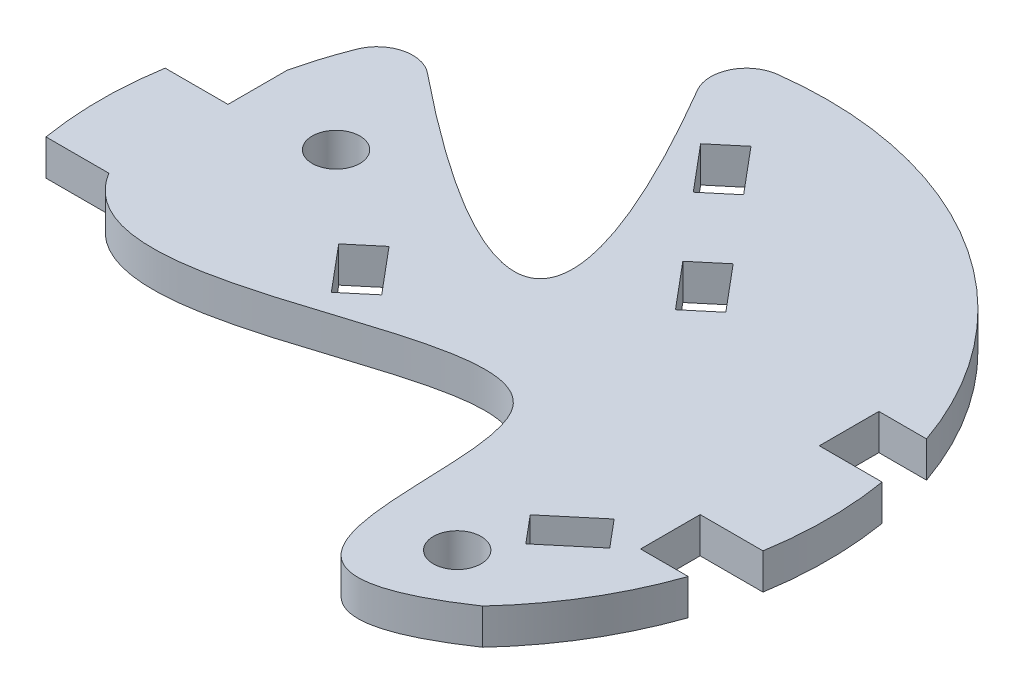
ISO-10303-21;
HEADER;
FILE_DESCRIPTION(('STEP AP214'),'2;1');
FILE_NAME('part.step','',(''),(''),'','','');
FILE_SCHEMA(('AUTOMOTIVE_DESIGN { 1 0 10303 214 1 1 1 1 }'));
ENDSEC;
DATA;
#1=APPLICATION_CONTEXT('core data for automotive mechanical design processes');
#2=APPLICATION_PROTOCOL_DEFINITION('international standard','automotive_design',2000,#1);
#3=PRODUCT_CONTEXT('',#1,'mechanical');
#4=PRODUCT('Part','Part','',(#3));
#5=PRODUCT_RELATED_PRODUCT_CATEGORY('part','',(#4));
#6=PRODUCT_DEFINITION_FORMATION('','',#4);
#7=PRODUCT_DEFINITION_CONTEXT('part definition',#1,'design');
#8=PRODUCT_DEFINITION('design','',#6,#7);
#9=PRODUCT_DEFINITION_SHAPE('','',#8);
#10=(LENGTH_UNIT() NAMED_UNIT(*) SI_UNIT(.MILLI.,.METRE.));
#11=(NAMED_UNIT(*) PLANE_ANGLE_UNIT() SI_UNIT($,.RADIAN.));
#12=(NAMED_UNIT(*) SI_UNIT($,.STERADIAN.) SOLID_ANGLE_UNIT());
#13=UNCERTAINTY_MEASURE_WITH_UNIT(LENGTH_MEASURE(1.E-05),#10,'distance_accuracy_value','');
#14=(GEOMETRIC_REPRESENTATION_CONTEXT(3) GLOBAL_UNCERTAINTY_ASSIGNED_CONTEXT((#13)) GLOBAL_UNIT_ASSIGNED_CONTEXT((#10,
#11,#12)) REPRESENTATION_CONTEXT('',''));
#15=CARTESIAN_POINT('',(0.,0.,0.));
#16=DIRECTION('',(0.,0.,1.));
#17=DIRECTION('',(1.,0.,0.));
#18=AXIS2_PLACEMENT_3D('',#15,#16,#17);
#19=CARTESIAN_POINT('',(0.,3.,0.));
#20=DIRECTION('',(0.,1.,0.));
#21=DIRECTION('',(0.,0.,1.));
#22=AXIS2_PLACEMENT_3D('',#19,#20,#21);
#23=PLANE('',#22);
#24=DIRECTION('',(0.642787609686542,0.,0.766044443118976));
#25=VECTOR('',#24,1.);
#26=CARTESIAN_POINT('',(4.40475554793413,3.,-3.69602875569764));
#27=LINE('',#26,#25);
#28=CARTESIAN_POINT('',(17.6970534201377,3.,12.1451149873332));
#29=VERTEX_POINT('',#28);
#30=CARTESIAN_POINT('',(19.6254162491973,3.,14.4432483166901));
#31=VERTEX_POINT('',#30);
#32=EDGE_CURVE('E508',#29,#31,#27,.T.);
#33=ORIENTED_EDGE('',*,*,#32,.F.);
#34=DIRECTION('',(0.766044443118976,0.,-0.642787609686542));
#35=VECTOR('',#34,1.);
#36=CARTESIAN_POINT('',(13.2922978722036,3.,15.8411437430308));
#37=LINE('',#36,#35);
#38=CARTESIAN_POINT('',(21.5272756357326,3.,8.9311769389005));
#39=VERTEX_POINT('',#38);
#40=EDGE_CURVE('E503',#29,#39,#37,.T.);
#41=ORIENTED_EDGE('',*,*,#40,.T.);
#42=DIRECTION('',(0.642787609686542,0.,0.766044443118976));
#43=VECTOR('',#42,1.);
#44=CARTESIAN_POINT('',(8.23497776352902,3.,-6.90996680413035));
#45=LINE('',#44,#43);
#46=CARTESIAN_POINT('',(23.4556384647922,3.,11.2293102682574));
#47=VERTEX_POINT('',#46);
#48=EDGE_CURVE('E514',#39,#47,#45,.T.);
#49=ORIENTED_EDGE('',*,*,#48,.T.);
#50=DIRECTION('',(0.766044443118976,0.,-0.642787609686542));
#51=VECTOR('',#50,1.);
#52=CARTESIAN_POINT('',(15.2206607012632,3.,18.1392770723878));
#53=LINE('',#52,#51);
#54=EDGE_CURVE('E511',#31,#47,#53,.T.);
#55=ORIENTED_EDGE('',*,*,#54,.F.);
#56=EDGE_LOOP('',(#33,#41,#49,#55));
#57=FACE_BOUND('',#56,.T.);
#58=CARTESIAN_POINT('',(-16.9835014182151,3.,-6.23863438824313));
#59=DIRECTION('',(0.,1.,0.));
#60=DIRECTION('',(0.,0.,1.));
#61=AXIS2_PLACEMENT_3D('',#58,#59,#60);
#62=CIRCLE('',#61,2.);
#63=CARTESIAN_POINT('',(-16.9835014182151,3.,-4.23863438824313));
#64=VERTEX_POINT('',#63);
#65=EDGE_CURVE('E530',#64,#64,#62,.F.);
#66=ORIENTED_EDGE('',*,*,#65,.T.);
#67=EDGE_LOOP('',(#66));
#68=FACE_BOUND('',#67,.T.);
#69=DIRECTION('',(-0.766044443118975,0.,0.642787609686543));
#70=VECTOR('',#69,1.);
#71=CARTESIAN_POINT('',(-3.90227068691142,3.,-4.65054511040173));
#72=LINE('',#71,#70);
#73=CARTESIAN_POINT('',(7.97141818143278,3.,-14.6137530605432));
#74=VERTEX_POINT('',#73);
#75=CARTESIAN_POINT('',(5.67328485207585,3.,-12.6853902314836));
#76=VERTEX_POINT('',#75);
#77=EDGE_CURVE('E620',#74,#76,#72,.T.);
#78=ORIENTED_EDGE('',*,*,#77,.F.);
#79=DIRECTION('',(0.642787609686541,0.,0.766044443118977));
#80=VECTOR('',#79,1.);
#81=CARTESIAN_POINT('',(11.8736888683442,3.,-9.96320795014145));
#82=LINE('',#81,#80);
#83=CARTESIAN_POINT('',(11.1853562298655,3.,-10.7835308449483));
#84=VERTEX_POINT('',#83);
#85=EDGE_CURVE('E610',#74,#84,#82,.T.);
#86=ORIENTED_EDGE('',*,*,#85,.T.);
#87=DIRECTION('',(-0.766044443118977,0.,0.642787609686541));
#88=VECTOR('',#87,1.);
#89=CARTESIAN_POINT('',(-0.688332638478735,3.,-0.820322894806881));
#90=LINE('',#89,#88);
#91=CARTESIAN_POINT('',(8.88722290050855,3.,-8.8551680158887));
#92=VERTEX_POINT('',#91);
#93=EDGE_CURVE('E626',#84,#92,#90,.T.);
#94=ORIENTED_EDGE('',*,*,#93,.T.);
#95=DIRECTION('',(0.64278760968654,0.,0.766044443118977));
#96=VECTOR('',#95,1.);
#97=CARTESIAN_POINT('',(9.57555553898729,3.,-8.03484512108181));
#98=LINE('',#97,#96);
#99=EDGE_CURVE('E623',#76,#92,#98,.T.);
#100=ORIENTED_EDGE('',*,*,#99,.F.);
#101=EDGE_LOOP('',(#78,#86,#94,#100));
#102=FACE_BOUND('',#101,.T.);
#103=CARTESIAN_POINT('',(0.,3.,0.));
#104=DIRECTION('',(0.,1.,0.));
#105=DIRECTION('',(0.,0.,1.));
#106=AXIS2_PLACEMENT_3D('',#103,#104,#105);
#107=CIRCLE('',#106,30.5);
#108=CARTESIAN_POINT('',(28.8140590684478,3.,-10.));
#109=VERTEX_POINT('',#108);
#110=CARTESIAN_POINT('',(-3.95861769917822,3.,-30.2420129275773));
#111=VERTEX_POINT('',#110);
#112=EDGE_CURVE('E788',#109,#111,#107,.T.);
#113=ORIENTED_EDGE('',*,*,#112,.T.);
#114=CARTESIAN_POINT('',(-3.56924546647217,3.,-27.2673887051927));
#115=DIRECTION('',(0.,1.,0.));
#116=DIRECTION('',(0.,0.,1.));
#117=AXIS2_PLACEMENT_3D('',#114,#115,#116);
#118=CIRCLE('',#117,3.);
#119=CARTESIAN_POINT('',(-6.16007700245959,3.,-25.7549099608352));
#120=VERTEX_POINT('',#119);
#121=EDGE_CURVE('E274',#111,#120,#118,.T.);
#122=ORIENTED_EDGE('',*,*,#121,.T.);
#123=CARTESIAN_POINT('',(-18.7453208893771,3.,-15.6645535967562));
#124=CARTESIAN_POINT('',(3.86700093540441,3.,2.57649625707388));
#125=CARTESIAN_POINT('',(8.09424648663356,3.,-2.49637913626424));
#126=CARTESIAN_POINT('',(-8.30734565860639,3.,-29.3468568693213));
#127=B_SPLINE_CURVE_WITH_KNOTS('',3,(#123,#124,#125,#126),.UNSPECIFIED.,.F.,.F.,(4,4),
(0.0405275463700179,1.),.UNSPECIFIED.);
#128=CARTESIAN_POINT('',(-18.7453208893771,3.,-15.6645535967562));
#129=VERTEX_POINT('',#128);
#130=EDGE_CURVE('E1199',#129,#120,#127,.T.);
#131=ORIENTED_EDGE('',*,*,#130,.F.);
#132=CARTESIAN_POINT('',(-20.6289102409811,3.,-13.3295822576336));
#133=DIRECTION('',(0.,1.,0.));
#134=DIRECTION('',(0.,0.,1.));
#135=AXIS2_PLACEMENT_3D('',#132,#133,#134);
#136=CIRCLE('',#135,3.);
#137=CARTESIAN_POINT('',(-23.4189051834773,3.,-14.4322736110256));
#138=VERTEX_POINT('',#137);
#139=EDGE_CURVE('E549',#138,#129,#136,.F.);
#140=ORIENTED_EDGE('',*,*,#139,.F.);
#141=CARTESIAN_POINT('',(-24.8140590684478,3.,5.));
#142=CARTESIAN_POINT('',(-26.3603422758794,3.,-1.58958445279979));
#143=CARTESIAN_POINT('',(-25.8362968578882,3.,-8.31586531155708));
#144=CARTESIAN_POINT('',(-23.4189051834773,3.,-14.4322736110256));
#145=B_SPLINE_CURVE_WITH_KNOTS('',3,(#141,#142,#143,#144),.UNSPECIFIED.,.F.,.F.,(4,4),(0.,
0.831813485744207),.UNSPECIFIED.);
#146=CARTESIAN_POINT('',(-24.8140590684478,3.,-10.));
#147=VERTEX_POINT('',#146);
#148=EDGE_CURVE('E1193',#147,#138,#145,.T.);
#149=ORIENTED_EDGE('',*,*,#148,.F.);
#150=DIRECTION('',(0.,0.,-1.));
#151=VECTOR('',#150,1.);
#152=CARTESIAN_POINT('',(-24.8140590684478,3.,0.));
#153=LINE('',#152,#151);
#154=CARTESIAN_POINT('',(-24.8140590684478,3.,-5.));
#155=VERTEX_POINT('',#154);
#156=EDGE_CURVE('E677',#155,#147,#153,.T.);
#157=ORIENTED_EDGE('',*,*,#156,.F.);
#158=DIRECTION('',(-1.,0.,0.));
#159=VECTOR('',#158,1.);
#160=CARTESIAN_POINT('',(0.,3.,-5.));
#161=LINE('',#160,#159);
#162=CARTESIAN_POINT('',(-30.0873727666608,3.,-5.));
#163=VERTEX_POINT('',#162);
#164=EDGE_CURVE('E674',#155,#163,#161,.T.);
#165=ORIENTED_EDGE('',*,*,#164,.T.);
#166=CARTESIAN_POINT('',(-30.0873727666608,3.,5.));
#167=VERTEX_POINT('',#166);
#168=EDGE_CURVE('E696',#163,#167,#107,.T.);
#169=ORIENTED_EDGE('',*,*,#168,.T.);
#170=DIRECTION('',(-1.,0.,0.));
#171=VECTOR('',#170,1.);
#172=CARTESIAN_POINT('',(0.,3.,5.00000000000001));
#173=LINE('',#172,#171);
#174=CARTESIAN_POINT('',(-24.8140590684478,3.,5.));
#175=VERTEX_POINT('',#174);
#176=EDGE_CURVE('E683',#175,#167,#173,.T.);
#177=ORIENTED_EDGE('',*,*,#176,.F.);
#178=CARTESIAN_POINT('',(22.3289408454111,3.,20.7766311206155));
#179=CARTESIAN_POINT('',(5.97375164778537,3.,31.8512079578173));
#180=CARTESIAN_POINT('',(22.176782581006,3.,-15.835204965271));
#181=CARTESIAN_POINT('',(-18.2068680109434,3.,15.8076452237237));
#182=CARTESIAN_POINT('',(-24.8140590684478,3.,5.));
#183=B_SPLINE_CURVE_WITH_KNOTS('',3,(#178,#179,#180,#181,#182),.UNSPECIFIED.,.F.,.F.,(4,1,4),
(0.,0.445790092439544,1.),.UNSPECIFIED.);
#184=CARTESIAN_POINT('',(22.3289408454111,3.,20.7766311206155));
#185=VERTEX_POINT('',#184);
#186=EDGE_CURVE('E595',#185,#175,#183,.T.);
#187=ORIENTED_EDGE('',*,*,#186,.F.);
#188=CARTESIAN_POINT('',(28.8140590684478,3.,10.));
#189=VERTEX_POINT('',#188);
#190=EDGE_CURVE('E692',#185,#189,#107,.T.);
#191=ORIENTED_EDGE('',*,*,#190,.T.);
#192=DIRECTION('',(1.,0.,0.));
#193=VECTOR('',#192,1.);
#194=CARTESIAN_POINT('',(0.,3.,10.));
#195=LINE('',#194,#193);
#196=CARTESIAN_POINT('',(24.8140590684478,3.,10.));
#197=VERTEX_POINT('',#196);
#198=EDGE_CURVE('E641',#197,#189,#195,.T.);
#199=ORIENTED_EDGE('',*,*,#198,.F.);
#200=DIRECTION('',(0.,0.,1.));
#201=VECTOR('',#200,1.);
#202=CARTESIAN_POINT('',(24.8140590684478,3.,0.));
#203=LINE('',#202,#201);
#204=CARTESIAN_POINT('',(24.8140590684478,3.,5.));
#205=VERTEX_POINT('',#204);
#206=EDGE_CURVE('E632',#205,#197,#203,.T.);
#207=ORIENTED_EDGE('',*,*,#206,.F.);
#208=DIRECTION('',(1.,0.,0.));
#209=VECTOR('',#208,1.);
#210=CARTESIAN_POINT('',(0.,3.,5.));
#211=LINE('',#210,#209);
#212=CARTESIAN_POINT('',(30.0873727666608,3.,5.));
#213=VERTEX_POINT('',#212);
#214=EDGE_CURVE('E644',#205,#213,#211,.T.);
#215=ORIENTED_EDGE('',*,*,#214,.T.);
#216=CARTESIAN_POINT('',(30.0873727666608,3.,-5.));
#217=VERTEX_POINT('',#216);
#218=EDGE_CURVE('E695',#213,#217,#107,.T.);
#219=ORIENTED_EDGE('',*,*,#218,.T.);
#220=DIRECTION('',(1.,0.,0.));
#221=VECTOR('',#220,1.);
#222=CARTESIAN_POINT('',(0.,3.,-5.00000000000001));
#223=LINE('',#222,#221);
#224=CARTESIAN_POINT('',(24.8140590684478,3.,-5.));
#225=VERTEX_POINT('',#224);
#226=EDGE_CURVE('E662',#225,#217,#223,.T.);
#227=ORIENTED_EDGE('',*,*,#226,.F.);
#228=DIRECTION('',(0.,0.,-1.));
#229=VECTOR('',#228,1.);
#230=CARTESIAN_POINT('',(24.8140590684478,3.,0.));
#231=LINE('',#230,#229);
#232=CARTESIAN_POINT('',(24.8140590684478,3.,-10.));
#233=VERTEX_POINT('',#232);
#234=EDGE_CURVE('E659',#225,#233,#231,.T.);
#235=ORIENTED_EDGE('',*,*,#234,.T.);
#236=DIRECTION('',(1.,0.,0.));
#237=VECTOR('',#236,1.);
#238=CARTESIAN_POINT('',(0.,3.,-10.));
#239=LINE('',#238,#237);
#240=EDGE_CURVE('E656',#233,#109,#239,.T.);
#241=ORIENTED_EDGE('',*,*,#240,.T.);
#242=EDGE_LOOP('',(#113,#122,#131,#140,#149,#157,#165,#169,#177,#187,#191,#199,#207,#215,#219,
#227,#235,#241));
#243=FACE_BOUND('',#242,.T.);
#244=DIRECTION('',(-0.766044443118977,0.,0.642787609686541));
#245=VECTOR('',#244,1.);
#246=CARTESIAN_POINT('',(-3.90227068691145,3.,-4.65054511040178));
#247=LINE('',#246,#245);
#248=CARTESIAN_POINT('',(-7.73249290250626,3.,-1.43660706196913));
#249=VERTEX_POINT('',#248);
#250=CARTESIAN_POINT('',(-10.0306262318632,3.,0.491755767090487));
#251=VERTEX_POINT('',#250);
#252=EDGE_CURVE('E537',#249,#251,#247,.T.);
#253=ORIENTED_EDGE('',*,*,#252,.F.);
#254=DIRECTION('',(0.642787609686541,0.,0.766044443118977));
#255=VECTOR('',#254,1.);
#256=CARTESIAN_POINT('',(-3.83022221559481,3.,3.21393804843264));
#257=LINE('',#256,#255);
#258=CARTESIAN_POINT('',(-4.51855485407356,3.,2.39361515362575));
#259=VERTEX_POINT('',#258);
#260=EDGE_CURVE('E534',#249,#259,#257,.T.);
#261=ORIENTED_EDGE('',*,*,#260,.T.);
#262=DIRECTION('',(0.766044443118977,0.,-0.642787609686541));
#263=VECTOR('',#262,1.);
#264=CARTESIAN_POINT('',(-0.688332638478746,3.,-0.820322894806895));
#265=LINE('',#264,#263);
#266=CARTESIAN_POINT('',(-6.81668818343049,3.,4.32197798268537));
#267=VERTEX_POINT('',#266);
#268=EDGE_CURVE('E543',#267,#259,#265,.T.);
#269=ORIENTED_EDGE('',*,*,#268,.F.);
#270=DIRECTION('',(0.642787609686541,0.,0.766044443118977));
#271=VECTOR('',#270,1.);
#272=CARTESIAN_POINT('',(-6.12835554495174,3.,5.14230087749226));
#273=LINE('',#272,#271);
#274=EDGE_CURVE('E540',#251,#267,#273,.T.);
#275=ORIENTED_EDGE('',*,*,#274,.F.);
#276=EDGE_LOOP('',(#253,#261,#269,#275));
#277=FACE_BOUND('',#276,.T.);
#278=CARTESIAN_POINT('',(17.204026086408,3.,17.7804431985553));
#279=DIRECTION('',(0.,1.,0.));
#280=DIRECTION('',(0.,0.,1.));
#281=AXIS2_PLACEMENT_3D('',#278,#279,#280);
#282=CIRCLE('',#281,2.);
#283=CARTESIAN_POINT('',(17.204026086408,3.,19.7804431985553));
#284=VERTEX_POINT('',#283);
#285=EDGE_CURVE('E520',#284,#284,#282,.F.);
#286=ORIENTED_EDGE('',*,*,#285,.T.);
#287=EDGE_LOOP('',(#286));
#288=FACE_BOUND('',#287,.T.);
#289=DIRECTION('',(-0.766044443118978,0.,0.642787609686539));
#290=VECTOR('',#289,1.);
#291=CARTESIAN_POINT('',(-11.6960704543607,3.,-13.9388339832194));
#292=LINE('',#291,#290);
#293=CARTESIAN_POINT('',(0.177618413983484,3.,-23.9020419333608));
#294=VERTEX_POINT('',#293);
#295=CARTESIAN_POINT('',(-2.12051491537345,3.,-21.9736791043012));
#296=VERTEX_POINT('',#295);
#297=EDGE_CURVE('E488',#294,#296,#292,.T.);
#298=ORIENTED_EDGE('',*,*,#297,.F.);
#299=DIRECTION('',(0.64278760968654,0.,0.766044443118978));
#300=VECTOR('',#299,1.);
#301=CARTESIAN_POINT('',(11.8736888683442,3.,-9.96320795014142));
#302=LINE('',#301,#300);
#303=CARTESIAN_POINT('',(3.39155646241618,3.,-20.0718197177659));
#304=VERTEX_POINT('',#303);
#305=EDGE_CURVE('E493',#294,#304,#302,.T.);
#306=ORIENTED_EDGE('',*,*,#305,.T.);
#307=DIRECTION('',(-0.766044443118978,0.,0.64278760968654));
#308=VECTOR('',#307,1.);
#309=CARTESIAN_POINT('',(-8.48213240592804,3.,-10.1086117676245));
#310=LINE('',#309,#308);
#311=CARTESIAN_POINT('',(1.09342313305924,3.,-18.1434568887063));
#312=VERTEX_POINT('',#311);
#313=EDGE_CURVE('E496',#304,#312,#310,.T.);
#314=ORIENTED_EDGE('',*,*,#313,.T.);
#315=DIRECTION('',(0.64278760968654,0.,0.766044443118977));
#316=VECTOR('',#315,1.);
#317=CARTESIAN_POINT('',(9.57555553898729,3.,-8.03484512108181));
#318=LINE('',#317,#316);
#319=EDGE_CURVE('E477',#296,#312,#318,.T.);
#320=ORIENTED_EDGE('',*,*,#319,.F.);
#321=EDGE_LOOP('',(#298,#306,#314,#320));
#322=FACE_BOUND('',#321,.T.);
#323=ADVANCED_FACE('F252',(#57,#68,#102,#243,#277,#288,#322),#23,.T.);
#324=CARTESIAN_POINT('',(0.,0.,0.));
#325=DIRECTION('',(0.,1.,0.));
#326=DIRECTION('',(0.,0.,1.));
#327=AXIS2_PLACEMENT_3D('',#324,#325,#326);
#328=PLANE('',#327);
#329=DIRECTION('',(0.766044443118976,0.,-0.642787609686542));
#330=VECTOR('',#329,1.);
#331=CARTESIAN_POINT('',(13.2922978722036,0.,15.8411437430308));
#332=LINE('',#331,#330);
#333=CARTESIAN_POINT('',(17.6970534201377,0.,12.1451149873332));
#334=VERTEX_POINT('',#333);
#335=CARTESIAN_POINT('',(21.5272756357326,0.,8.9311769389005));
#336=VERTEX_POINT('',#335);
#337=EDGE_CURVE('E770',#334,#336,#332,.T.);
#338=ORIENTED_EDGE('',*,*,#337,.F.);
#339=DIRECTION('',(0.642787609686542,0.,0.766044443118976));
#340=VECTOR('',#339,1.);
#341=CARTESIAN_POINT('',(4.40475554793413,0.,-3.69602875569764));
#342=LINE('',#341,#340);
#343=CARTESIAN_POINT('',(19.6254162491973,0.,14.4432483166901));
#344=VERTEX_POINT('',#343);
#345=EDGE_CURVE('E758',#334,#344,#342,.T.);
#346=ORIENTED_EDGE('',*,*,#345,.T.);
#347=DIRECTION('',(0.766044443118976,0.,-0.642787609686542));
#348=VECTOR('',#347,1.);
#349=CARTESIAN_POINT('',(15.2206607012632,0.,18.1392770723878));
#350=LINE('',#349,#348);
#351=CARTESIAN_POINT('',(23.4556384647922,0.,11.2293102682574));
#352=VERTEX_POINT('',#351);
#353=EDGE_CURVE('E765',#344,#352,#350,.T.);
#354=ORIENTED_EDGE('',*,*,#353,.T.);
#355=DIRECTION('',(0.642787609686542,0.,0.766044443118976));
#356=VECTOR('',#355,1.);
#357=CARTESIAN_POINT('',(8.23497776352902,0.,-6.90996680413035));
#358=LINE('',#357,#356);
#359=EDGE_CURVE('E768',#336,#352,#358,.T.);
#360=ORIENTED_EDGE('',*,*,#359,.F.);
#361=EDGE_LOOP('',(#338,#346,#354,#360));
#362=FACE_BOUND('',#361,.T.);
#363=CARTESIAN_POINT('',(-16.9835014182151,0.,-6.23863438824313));
#364=DIRECTION('',(0.,1.,0.));
#365=DIRECTION('',(0.,0.,1.));
#366=AXIS2_PLACEMENT_3D('',#363,#364,#365);
#367=CIRCLE('',#366,2.);
#368=CARTESIAN_POINT('',(-16.9835014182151,0.,-4.23863438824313));
#369=VERTEX_POINT('',#368);
#370=EDGE_CURVE('E533',#369,#369,#367,.F.);
#371=ORIENTED_EDGE('',*,*,#370,.F.);
#372=EDGE_LOOP('',(#371));
#373=FACE_BOUND('',#372,.T.);
#374=DIRECTION('',(0.642787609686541,0.,0.766044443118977));
#375=VECTOR('',#374,1.);
#376=CARTESIAN_POINT('',(11.8736888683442,0.,-9.96320795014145));
#377=LINE('',#376,#375);
#378=CARTESIAN_POINT('',(7.97141818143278,0.,-14.6137530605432));
#379=VERTEX_POINT('',#378);
#380=CARTESIAN_POINT('',(11.1853562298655,0.,-10.7835308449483));
#381=VERTEX_POINT('',#380);
#382=EDGE_CURVE('E727',#379,#381,#377,.T.);
#383=ORIENTED_EDGE('',*,*,#382,.F.);
#384=DIRECTION('',(-0.766044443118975,0.,0.642787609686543));
#385=VECTOR('',#384,1.);
#386=CARTESIAN_POINT('',(-3.90227068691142,0.,-4.65054511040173));
#387=LINE('',#386,#385);
#388=CARTESIAN_POINT('',(5.67328485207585,0.,-12.6853902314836));
#389=VERTEX_POINT('',#388);
#390=EDGE_CURVE('E719',#379,#389,#387,.T.);
#391=ORIENTED_EDGE('',*,*,#390,.T.);
#392=DIRECTION('',(0.64278760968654,0.,0.766044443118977));
#393=VECTOR('',#392,1.);
#394=CARTESIAN_POINT('',(9.57555553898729,0.,-8.03484512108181));
#395=LINE('',#394,#393);
#396=CARTESIAN_POINT('',(8.88722290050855,0.,-8.8551680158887));
#397=VERTEX_POINT('',#396);
#398=EDGE_CURVE('E722',#389,#397,#395,.T.);
#399=ORIENTED_EDGE('',*,*,#398,.T.);
#400=DIRECTION('',(-0.766044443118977,0.,0.642787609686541));
#401=VECTOR('',#400,1.);
#402=CARTESIAN_POINT('',(-0.688332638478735,0.,-0.820322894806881));
#403=LINE('',#402,#401);
#404=EDGE_CURVE('E725',#381,#397,#403,.T.);
#405=ORIENTED_EDGE('',*,*,#404,.F.);
#406=EDGE_LOOP('',(#383,#391,#399,#405));
#407=FACE_BOUND('',#406,.T.);
#408=CARTESIAN_POINT('',(-18.7453208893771,0.,-15.6645535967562));
#409=CARTESIAN_POINT('',(3.86700093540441,0.,2.57649625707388));
#410=CARTESIAN_POINT('',(8.09424648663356,0.,-2.49637913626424));
#411=CARTESIAN_POINT('',(-8.30734565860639,0.,-29.3468568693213));
#412=B_SPLINE_CURVE_WITH_KNOTS('',3,(#408,#409,#410,#411),.UNSPECIFIED.,.F.,.F.,(4,4),
(0.0405275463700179,1.),.UNSPECIFIED.);
#413=CARTESIAN_POINT('',(-18.7453208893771,0.,-15.6645535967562));
#414=VERTEX_POINT('',#413);
#415=CARTESIAN_POINT('',(-6.16007700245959,0.,-25.7549099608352));
#416=VERTEX_POINT('',#415);
#417=EDGE_CURVE('E591',#414,#416,#412,.T.);
#418=ORIENTED_EDGE('',*,*,#417,.T.);
#419=CARTESIAN_POINT('',(-3.56924546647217,0.,-27.2673887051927));
#420=DIRECTION('',(0.,1.,0.));
#421=DIRECTION('',(0.,0.,1.));
#422=AXIS2_PLACEMENT_3D('',#419,#420,#421);
#423=CIRCLE('',#422,3.);
#424=CARTESIAN_POINT('',(-3.95861769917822,0.,-30.2420129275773));
#425=VERTEX_POINT('',#424);
#426=EDGE_CURVE('E12',#416,#425,#423,.F.);
#427=ORIENTED_EDGE('',*,*,#426,.T.);
#428=CARTESIAN_POINT('',(0.,0.,0.));
#429=DIRECTION('',(0.,1.,0.));
#430=DIRECTION('',(0.,0.,1.));
#431=AXIS2_PLACEMENT_3D('',#428,#429,#430);
#432=CIRCLE('',#431,30.5);
#433=CARTESIAN_POINT('',(28.8140590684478,0.,-10.));
#434=VERTEX_POINT('',#433);
#435=EDGE_CURVE('E790',#434,#425,#432,.T.);
#436=ORIENTED_EDGE('',*,*,#435,.F.);
#437=DIRECTION('',(1.,0.,0.));
#438=VECTOR('',#437,1.);
#439=CARTESIAN_POINT('',(0.,0.,-10.));
#440=LINE('',#439,#438);
#441=CARTESIAN_POINT('',(24.8140590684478,0.,-10.));
#442=VERTEX_POINT('',#441);
#443=EDGE_CURVE('E672',#442,#434,#440,.T.);
#444=ORIENTED_EDGE('',*,*,#443,.F.);
#445=DIRECTION('',(0.,0.,-1.));
#446=VECTOR('',#445,1.);
#447=CARTESIAN_POINT('',(24.8140590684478,0.,0.));
#448=LINE('',#447,#446);
#449=CARTESIAN_POINT('',(24.8140590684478,0.,-5.));
#450=VERTEX_POINT('',#449);
#451=EDGE_CURVE('E709',#450,#442,#448,.T.);
#452=ORIENTED_EDGE('',*,*,#451,.F.);
#453=DIRECTION('',(1.,0.,0.));
#454=VECTOR('',#453,1.);
#455=CARTESIAN_POINT('',(0.,0.,-5.00000000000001));
#456=LINE('',#455,#454);
#457=CARTESIAN_POINT('',(30.0873727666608,0.,-5.));
#458=VERTEX_POINT('',#457);
#459=EDGE_CURVE('E668',#450,#458,#456,.T.);
#460=ORIENTED_EDGE('',*,*,#459,.T.);
#461=CARTESIAN_POINT('',(30.0873727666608,0.,5.));
#462=VERTEX_POINT('',#461);
#463=EDGE_CURVE('E699',#462,#458,#432,.T.);
#464=ORIENTED_EDGE('',*,*,#463,.F.);
#465=DIRECTION('',(1.,0.,0.));
#466=VECTOR('',#465,1.);
#467=CARTESIAN_POINT('',(0.,0.,5.));
#468=LINE('',#467,#466);
#469=CARTESIAN_POINT('',(24.8140590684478,0.,5.));
#470=VERTEX_POINT('',#469);
#471=EDGE_CURVE('E654',#470,#462,#468,.T.);
#472=ORIENTED_EDGE('',*,*,#471,.F.);
#473=DIRECTION('',(0.,0.,1.));
#474=VECTOR('',#473,1.);
#475=CARTESIAN_POINT('',(24.8140590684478,0.,0.));
#476=LINE('',#475,#474);
#477=CARTESIAN_POINT('',(24.8140590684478,0.,10.));
#478=VERTEX_POINT('',#477);
#479=EDGE_CURVE('E716',#470,#478,#476,.T.);
#480=ORIENTED_EDGE('',*,*,#479,.T.);
#481=DIRECTION('',(1.,0.,0.));
#482=VECTOR('',#481,1.);
#483=CARTESIAN_POINT('',(0.,0.,10.));
#484=LINE('',#483,#482);
#485=CARTESIAN_POINT('',(28.8140590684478,0.,10.));
#486=VERTEX_POINT('',#485);
#487=EDGE_CURVE('E650',#478,#486,#484,.T.);
#488=ORIENTED_EDGE('',*,*,#487,.T.);
#489=CARTESIAN_POINT('',(22.3289408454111,0.,20.7766311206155));
#490=VERTEX_POINT('',#489);
#491=EDGE_CURVE('E697',#490,#486,#432,.T.);
#492=ORIENTED_EDGE('',*,*,#491,.F.);
#493=CARTESIAN_POINT('',(22.3289408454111,0.,20.7766311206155));
#494=CARTESIAN_POINT('',(5.97375164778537,0.,31.8512079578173));
#495=CARTESIAN_POINT('',(22.176782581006,0.,-15.835204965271));
#496=CARTESIAN_POINT('',(-18.2068680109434,0.,15.8076452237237));
#497=CARTESIAN_POINT('',(-24.8140590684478,0.,5.));
#498=B_SPLINE_CURVE_WITH_KNOTS('',3,(#493,#494,#495,#496,#497),.UNSPECIFIED.,.F.,.F.,(4,1,4),
(0.,0.445790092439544,1.),.UNSPECIFIED.);
#499=CARTESIAN_POINT('',(-24.8140590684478,0.,5.));
#500=VERTEX_POINT('',#499);
#501=EDGE_CURVE('E607',#490,#500,#498,.T.);
#502=ORIENTED_EDGE('',*,*,#501,.T.);
#503=DIRECTION('',(-1.,0.,0.));
#504=VECTOR('',#503,1.);
#505=CARTESIAN_POINT('',(0.,0.,5.00000000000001));
#506=LINE('',#505,#504);
#507=CARTESIAN_POINT('',(-30.0873727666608,0.,5.));
#508=VERTEX_POINT('',#507);
#509=EDGE_CURVE('E694',#500,#508,#506,.T.);
#510=ORIENTED_EDGE('',*,*,#509,.T.);
#511=CARTESIAN_POINT('',(-30.0873727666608,0.,-5.));
#512=VERTEX_POINT('',#511);
#513=EDGE_CURVE('E700',#512,#508,#432,.T.);
#514=ORIENTED_EDGE('',*,*,#513,.F.);
#515=DIRECTION('',(-1.,0.,0.));
#516=VECTOR('',#515,1.);
#517=CARTESIAN_POINT('',(0.,0.,-5.));
#518=LINE('',#517,#516);
#519=CARTESIAN_POINT('',(-24.8140590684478,0.,-5.));
#520=VERTEX_POINT('',#519);
#521=EDGE_CURVE('E701',#520,#512,#518,.T.);
#522=ORIENTED_EDGE('',*,*,#521,.F.);
#523=DIRECTION('',(0.,0.,-1.));
#524=VECTOR('',#523,1.);
#525=CARTESIAN_POINT('',(-24.8140590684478,0.,0.));
#526=LINE('',#525,#524);
#527=CARTESIAN_POINT('',(-24.8140590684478,0.,-10.));
#528=VERTEX_POINT('',#527);
#529=EDGE_CURVE('E704',#520,#528,#526,.T.);
#530=ORIENTED_EDGE('',*,*,#529,.T.);
#531=CARTESIAN_POINT('',(-24.8140590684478,0.,5.));
#532=CARTESIAN_POINT('',(-26.3603422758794,0.,-1.58958445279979));
#533=CARTESIAN_POINT('',(-25.8362968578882,0.,-8.31586531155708));
#534=CARTESIAN_POINT('',(-23.4189051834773,0.,-14.4322736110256));
#535=B_SPLINE_CURVE_WITH_KNOTS('',3,(#531,#532,#533,#534),.UNSPECIFIED.,.F.,.F.,(4,4),(0.,
0.831813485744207),.UNSPECIFIED.);
#536=CARTESIAN_POINT('',(-23.4189051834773,0.,-14.4322736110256));
#537=VERTEX_POINT('',#536);
#538=EDGE_CURVE('E1181',#528,#537,#535,.T.);
#539=ORIENTED_EDGE('',*,*,#538,.T.);
#540=CARTESIAN_POINT('',(-20.6289102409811,0.,-13.3295822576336));
#541=DIRECTION('',(0.,1.,0.));
#542=DIRECTION('',(0.,0.,1.));
#543=AXIS2_PLACEMENT_3D('',#540,#541,#542);
#544=CIRCLE('',#543,3.);
#545=EDGE_CURVE('E729',#537,#414,#544,.F.);
#546=ORIENTED_EDGE('',*,*,#545,.T.);
#547=EDGE_LOOP('',(#418,#427,#436,#444,#452,#460,#464,#472,#480,#488,#492,#502,#510,#514,#522,
#530,#539,#546));
#548=FACE_BOUND('',#547,.T.);
#549=DIRECTION('',(0.642787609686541,0.,0.766044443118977));
#550=VECTOR('',#549,1.);
#551=CARTESIAN_POINT('',(-3.83022221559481,0.,3.21393804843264));
#552=LINE('',#551,#550);
#553=CARTESIAN_POINT('',(-7.73249290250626,0.,-1.43660706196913));
#554=VERTEX_POINT('',#553);
#555=CARTESIAN_POINT('',(-4.51855485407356,0.,2.39361515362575));
#556=VERTEX_POINT('',#555);
#557=EDGE_CURVE('E756',#554,#556,#552,.T.);
#558=ORIENTED_EDGE('',*,*,#557,.F.);
#559=DIRECTION('',(-0.766044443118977,0.,0.642787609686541));
#560=VECTOR('',#559,1.);
#561=CARTESIAN_POINT('',(-3.90227068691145,0.,-4.65054511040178));
#562=LINE('',#561,#560);
#563=CARTESIAN_POINT('',(-10.0306262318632,0.,0.491755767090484));
#564=VERTEX_POINT('',#563);
#565=EDGE_CURVE('E740',#554,#564,#562,.T.);
#566=ORIENTED_EDGE('',*,*,#565,.T.);
#567=DIRECTION('',(0.642787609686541,0.,0.766044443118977));
#568=VECTOR('',#567,1.);
#569=CARTESIAN_POINT('',(-6.12835554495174,0.,5.14230087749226));
#570=LINE('',#569,#568);
#571=CARTESIAN_POINT('',(-6.81668818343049,0.,4.32197798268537));
#572=VERTEX_POINT('',#571);
#573=EDGE_CURVE('E750',#564,#572,#570,.T.);
#574=ORIENTED_EDGE('',*,*,#573,.T.);
#575=DIRECTION('',(0.766044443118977,0.,-0.642787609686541));
#576=VECTOR('',#575,1.);
#577=CARTESIAN_POINT('',(-0.688332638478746,0.,-0.820322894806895));
#578=LINE('',#577,#576);
#579=EDGE_CURVE('E753',#572,#556,#578,.T.);
#580=ORIENTED_EDGE('',*,*,#579,.T.);
#581=EDGE_LOOP('',(#558,#566,#574,#580));
#582=FACE_BOUND('',#581,.T.);
#583=CARTESIAN_POINT('',(17.204026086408,0.,17.7804431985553));
#584=DIRECTION('',(0.,1.,0.));
#585=DIRECTION('',(0.,0.,1.));
#586=AXIS2_PLACEMENT_3D('',#583,#584,#585);
#587=CIRCLE('',#586,2.);
#588=CARTESIAN_POINT('',(17.204026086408,0.,19.7804431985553));
#589=VERTEX_POINT('',#588);
#590=EDGE_CURVE('E529',#589,#589,#587,.F.);
#591=ORIENTED_EDGE('',*,*,#590,.F.);
#592=EDGE_LOOP('',(#591));
#593=FACE_BOUND('',#592,.T.);
#594=DIRECTION('',(0.64278760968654,0.,0.766044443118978));
#595=VECTOR('',#594,1.);
#596=CARTESIAN_POINT('',(11.8736888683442,0.,-9.96320795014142));
#597=LINE('',#596,#595);
#598=CARTESIAN_POINT('',(0.177618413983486,0.,-23.9020419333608));
#599=VERTEX_POINT('',#598);
#600=CARTESIAN_POINT('',(3.39155646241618,0.,-20.0718197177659));
#601=VERTEX_POINT('',#600);
#602=EDGE_CURVE('E777',#599,#601,#597,.T.);
#603=ORIENTED_EDGE('',*,*,#602,.F.);
#604=DIRECTION('',(-0.766044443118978,0.,0.642787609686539));
#605=VECTOR('',#604,1.);
#606=CARTESIAN_POINT('',(-11.6960704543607,0.,-13.9388339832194));
#607=LINE('',#606,#605);
#608=CARTESIAN_POINT('',(-2.12051491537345,0.,-21.9736791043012));
#609=VERTEX_POINT('',#608);
#610=EDGE_CURVE('E772',#599,#609,#607,.T.);
#611=ORIENTED_EDGE('',*,*,#610,.T.);
#612=DIRECTION('',(0.64278760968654,0.,0.766044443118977));
#613=VECTOR('',#612,1.);
#614=CARTESIAN_POINT('',(9.57555553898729,0.,-8.03484512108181));
#615=LINE('',#614,#613);
#616=CARTESIAN_POINT('',(1.09342313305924,0.,-18.1434568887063));
#617=VERTEX_POINT('',#616);
#618=EDGE_CURVE('E480',#609,#617,#615,.T.);
#619=ORIENTED_EDGE('',*,*,#618,.T.);
#620=DIRECTION('',(-0.766044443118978,0.,0.642787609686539));
#621=VECTOR('',#620,1.);
#622=CARTESIAN_POINT('',(-8.48213240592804,0.,-10.1086117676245));
#623=LINE('',#622,#621);
#624=EDGE_CURVE('E775',#601,#617,#623,.T.);
#625=ORIENTED_EDGE('',*,*,#624,.F.);
#626=EDGE_LOOP('',(#603,#611,#619,#625));
#627=FACE_BOUND('',#626,.T.);
#628=ADVANCED_FACE('F822',(#362,#373,#407,#548,#582,#593,#627),#328,.F.);
#629=CARTESIAN_POINT('',(0.,3.,0.));
#630=DIRECTION('',(0.,-1.,0.));
#631=DIRECTION('',(0.,0.,-1.));
#632=AXIS2_PLACEMENT_3D('',#629,#630,#631);
#633=CYLINDRICAL_SURFACE('',#632,30.5);
#634=DIRECTION('',(0.,-1.,0.));
#635=VECTOR('',#634,1.);
#636=CARTESIAN_POINT('',(30.0873727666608,3.,5.));
#637=LINE('',#636,#635);
#638=EDGE_CURVE('E714',#462,#213,#637,.F.);
#639=ORIENTED_EDGE('',*,*,#638,.F.);
#640=ORIENTED_EDGE('',*,*,#463,.T.);
#641=DIRECTION('',(0.,-1.,0.));
#642=VECTOR('',#641,1.);
#643=CARTESIAN_POINT('',(30.0873727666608,3.,-5.));
#644=LINE('',#643,#642);
#645=EDGE_CURVE('E703',#458,#217,#644,.F.);
#646=ORIENTED_EDGE('',*,*,#645,.T.);
#647=ORIENTED_EDGE('',*,*,#218,.F.);
#648=EDGE_LOOP('',(#639,#640,#646,#647));
#649=FACE_BOUND('',#648,.T.);
#650=ADVANCED_FACE('F814',(#649),#633,.T.);
#651=ORIENTED_EDGE('',*,*,#435,.T.);
#652=DIRECTION('',(0.,-1.,0.));
#653=VECTOR('',#652,1.);
#654=CARTESIAN_POINT('',(-3.95861769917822,3.,-30.2420129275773));
#655=LINE('',#654,#653);
#656=EDGE_CURVE('E779',#425,#111,#655,.F.);
#657=ORIENTED_EDGE('',*,*,#656,.T.);
#658=ORIENTED_EDGE('',*,*,#112,.F.);
#659=DIRECTION('',(0.,-1.,0.));
#660=VECTOR('',#659,1.);
#661=CARTESIAN_POINT('',(28.8140590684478,3.,-10.));
#662=LINE('',#661,#660);
#663=EDGE_CURVE('E707',#434,#109,#662,.F.);
#664=ORIENTED_EDGE('',*,*,#663,.F.);
#665=EDGE_LOOP('',(#651,#657,#658,#664));
#666=FACE_BOUND('',#665,.T.);
#667=ADVANCED_FACE('F786',(#666),#633,.T.);
#668=DIRECTION('',(0.,1.,0.));
#669=VECTOR('',#668,1.);
#670=CARTESIAN_POINT('',(-30.0873727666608,-1.,-5.));
#671=LINE('',#670,#669);
#672=EDGE_CURVE('E681',#512,#163,#671,.T.);
#673=ORIENTED_EDGE('',*,*,#672,.F.);
#674=ORIENTED_EDGE('',*,*,#513,.T.);
#675=DIRECTION('',(0.,1.,0.));
#676=VECTOR('',#675,1.);
#677=CARTESIAN_POINT('',(-30.0873727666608,-1.,5.));
#678=LINE('',#677,#676);
#679=EDGE_CURVE('E688',#508,#167,#678,.T.);
#680=ORIENTED_EDGE('',*,*,#679,.T.);
#681=ORIENTED_EDGE('',*,*,#168,.F.);
#682=EDGE_LOOP('',(#673,#674,#680,#681));
#683=FACE_BOUND('',#682,.T.);
#684=ADVANCED_FACE('F806',(#683),#633,.T.);
#685=ORIENTED_EDGE('',*,*,#190,.F.);
#686=DIRECTION('',(0.,1.,0.));
#687=VECTOR('',#686,1.);
#688=CARTESIAN_POINT('',(22.3289408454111,-7.,20.7766311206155));
#689=LINE('',#688,#687);
#690=EDGE_CURVE('E602',#490,#185,#689,.T.);
#691=ORIENTED_EDGE('',*,*,#690,.F.);
#692=ORIENTED_EDGE('',*,*,#491,.T.);
#693=DIRECTION('',(0.,-1.,0.));
#694=VECTOR('',#693,1.);
#695=CARTESIAN_POINT('',(28.8140590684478,3.,10.));
#696=LINE('',#695,#694);
#697=EDGE_CURVE('E711',#486,#189,#696,.F.);
#698=ORIENTED_EDGE('',*,*,#697,.T.);
#699=EDGE_LOOP('',(#685,#691,#692,#698));
#700=FACE_BOUND('',#699,.T.);
#701=ADVANCED_FACE('F846',(#700),#633,.T.);
#702=CARTESIAN_POINT('',(0.,-1.,5.00000000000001));
#703=DIRECTION('',(0.,0.,-1.));
#704=DIRECTION('',(-1.,0.,0.));
#705=AXIS2_PLACEMENT_3D('',#702,#703,#704);
#706=PLANE('',#705);
#707=DIRECTION('',(0.,1.,0.));
#708=VECTOR('',#707,1.);
#709=CARTESIAN_POINT('',(-24.8140590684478,-1.,5.));
#710=LINE('',#709,#708);
#711=EDGE_CURVE('E691',#500,#175,#710,.T.);
#712=ORIENTED_EDGE('',*,*,#711,.T.);
#713=ORIENTED_EDGE('',*,*,#176,.T.);
#714=ORIENTED_EDGE('',*,*,#679,.F.);
#715=ORIENTED_EDGE('',*,*,#509,.F.);
#716=EDGE_LOOP('',(#712,#713,#714,#715));
#717=FACE_BOUND('',#716,.T.);
#718=ADVANCED_FACE('F804',(#717),#706,.F.);
#719=CARTESIAN_POINT('',(0.,-1.,-5.));
#720=DIRECTION('',(0.,0.,-1.));
#721=DIRECTION('',(-1.,0.,0.));
#722=AXIS2_PLACEMENT_3D('',#719,#720,#721);
#723=PLANE('',#722);
#724=ORIENTED_EDGE('',*,*,#521,.T.);
#725=ORIENTED_EDGE('',*,*,#672,.T.);
#726=ORIENTED_EDGE('',*,*,#164,.F.);
#727=DIRECTION('',(0.,1.,0.));
#728=VECTOR('',#727,1.);
#729=CARTESIAN_POINT('',(-24.8140590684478,-1.,-5.));
#730=LINE('',#729,#728);
#731=EDGE_CURVE('E680',#520,#155,#730,.T.);
#732=ORIENTED_EDGE('',*,*,#731,.F.);
#733=EDGE_LOOP('',(#724,#725,#726,#732));
#734=FACE_BOUND('',#733,.T.);
#735=ADVANCED_FACE('F853',(#734),#723,.T.);
#736=CARTESIAN_POINT('',(-24.8140590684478,-1.,0.));
#737=DIRECTION('',(1.,0.,0.));
#738=DIRECTION('',(0.,0.,-1.));
#739=AXIS2_PLACEMENT_3D('',#736,#737,#738);
#740=PLANE('',#739);
#741=ORIENTED_EDGE('',*,*,#731,.T.);
#742=ORIENTED_EDGE('',*,*,#156,.T.);
#743=DIRECTION('',(0.,1.,0.));
#744=VECTOR('',#743,1.);
#745=CARTESIAN_POINT('',(-24.8140590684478,-1.,-10.));
#746=LINE('',#745,#744);
#747=EDGE_CURVE('E684',#528,#147,#746,.T.);
#748=ORIENTED_EDGE('',*,*,#747,.F.);
#749=ORIENTED_EDGE('',*,*,#529,.F.);
#750=EDGE_LOOP('',(#741,#742,#748,#749));
#751=FACE_BOUND('',#750,.T.);
#752=ADVANCED_FACE('F869',(#751),#740,.F.);
#753=CARTESIAN_POINT('',(24.8140590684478,-1.,0.));
#754=DIRECTION('',(1.,0.,0.));
#755=DIRECTION('',(0.,0.,-1.));
#756=AXIS2_PLACEMENT_3D('',#753,#754,#755);
#757=PLANE('',#756);
#758=ORIENTED_EDGE('',*,*,#451,.T.);
#759=DIRECTION('',(0.,1.,0.));
#760=VECTOR('',#759,1.);
#761=CARTESIAN_POINT('',(24.8140590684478,-1.,-10.));
#762=LINE('',#761,#760);
#763=EDGE_CURVE('E665',#442,#233,#762,.T.);
#764=ORIENTED_EDGE('',*,*,#763,.T.);
#765=ORIENTED_EDGE('',*,*,#234,.F.);
#766=DIRECTION('',(0.,1.,0.));
#767=VECTOR('',#766,1.);
#768=CARTESIAN_POINT('',(24.8140590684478,-1.,-5.));
#769=LINE('',#768,#767);
#770=EDGE_CURVE('E666',#450,#225,#769,.T.);
#771=ORIENTED_EDGE('',*,*,#770,.F.);
#772=EDGE_LOOP('',(#758,#764,#765,#771));
#773=FACE_BOUND('',#772,.T.);
#774=ADVANCED_FACE('F827',(#773),#757,.T.);
#775=CARTESIAN_POINT('',(0.,-1.,-10.));
#776=DIRECTION('',(0.,0.,1.));
#777=DIRECTION('',(1.,0.,0.));
#778=AXIS2_PLACEMENT_3D('',#775,#776,#777);
#779=PLANE('',#778);
#780=ORIENTED_EDGE('',*,*,#443,.T.);
#781=ORIENTED_EDGE('',*,*,#663,.T.);
#782=ORIENTED_EDGE('',*,*,#240,.F.);
#783=ORIENTED_EDGE('',*,*,#763,.F.);
#784=EDGE_LOOP('',(#780,#781,#782,#783));
#785=FACE_BOUND('',#784,.T.);
#786=ADVANCED_FACE('F830',(#785),#779,.T.);
#787=CARTESIAN_POINT('',(0.,-1.,-5.00000000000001));
#788=DIRECTION('',(0.,0.,1.));
#789=DIRECTION('',(1.,0.,0.));
#790=AXIS2_PLACEMENT_3D('',#787,#788,#789);
#791=PLANE('',#790);
#792=ORIENTED_EDGE('',*,*,#770,.T.);
#793=ORIENTED_EDGE('',*,*,#226,.T.);
#794=ORIENTED_EDGE('',*,*,#645,.F.);
#795=ORIENTED_EDGE('',*,*,#459,.F.);
#796=EDGE_LOOP('',(#792,#793,#794,#795));
#797=FACE_BOUND('',#796,.T.);
#798=ADVANCED_FACE('F818',(#797),#791,.F.);
#799=CARTESIAN_POINT('',(24.8140590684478,-1.,0.));
#800=DIRECTION('',(-1.,0.,0.));
#801=DIRECTION('',(0.,0.,1.));
#802=AXIS2_PLACEMENT_3D('',#799,#800,#801);
#803=PLANE('',#802);
#804=DIRECTION('',(0.,1.,0.));
#805=VECTOR('',#804,1.);
#806=CARTESIAN_POINT('',(24.8140590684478,-1.,5.));
#807=LINE('',#806,#805);
#808=EDGE_CURVE('E648',#470,#205,#807,.T.);
#809=ORIENTED_EDGE('',*,*,#808,.T.);
#810=ORIENTED_EDGE('',*,*,#206,.T.);
#811=DIRECTION('',(0.,1.,0.));
#812=VECTOR('',#811,1.);
#813=CARTESIAN_POINT('',(24.8140590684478,-1.,10.));
#814=LINE('',#813,#812);
#815=EDGE_CURVE('E647',#478,#197,#814,.T.);
#816=ORIENTED_EDGE('',*,*,#815,.F.);
#817=ORIENTED_EDGE('',*,*,#479,.F.);
#818=EDGE_LOOP('',(#809,#810,#816,#817));
#819=FACE_BOUND('',#818,.T.);
#820=ADVANCED_FACE('F840',(#819),#803,.F.);
#821=CARTESIAN_POINT('',(0.,-1.,5.));
#822=DIRECTION('',(0.,0.,1.));
#823=DIRECTION('',(1.,0.,0.));
#824=AXIS2_PLACEMENT_3D('',#821,#822,#823);
#825=PLANE('',#824);
#826=ORIENTED_EDGE('',*,*,#471,.T.);
#827=ORIENTED_EDGE('',*,*,#638,.T.);
#828=ORIENTED_EDGE('',*,*,#214,.F.);
#829=ORIENTED_EDGE('',*,*,#808,.F.);
#830=EDGE_LOOP('',(#826,#827,#828,#829));
#831=FACE_BOUND('',#830,.T.);
#832=ADVANCED_FACE('F836',(#831),#825,.T.);
#833=CARTESIAN_POINT('',(0.,-1.,10.));
#834=DIRECTION('',(0.,0.,1.));
#835=DIRECTION('',(1.,0.,0.));
#836=AXIS2_PLACEMENT_3D('',#833,#834,#835);
#837=PLANE('',#836);
#838=ORIENTED_EDGE('',*,*,#815,.T.);
#839=ORIENTED_EDGE('',*,*,#198,.T.);
#840=ORIENTED_EDGE('',*,*,#697,.F.);
#841=ORIENTED_EDGE('',*,*,#487,.F.);
#842=EDGE_LOOP('',(#838,#839,#840,#841));
#843=FACE_BOUND('',#842,.T.);
#844=ADVANCED_FACE('F842',(#843),#837,.F.);
#845=CARTESIAN_POINT('',(11.8736888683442,-7.,-9.96320795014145));
#846=DIRECTION('',(-0.766044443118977,0.,0.642787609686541));
#847=DIRECTION('',(0.642787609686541,0.,0.766044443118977));
#848=AXIS2_PLACEMENT_3D('',#845,#846,#847);
#849=PLANE('',#848);
#850=ORIENTED_EDGE('',*,*,#382,.T.);
#851=DIRECTION('',(0.,1.,0.));
#852=VECTOR('',#851,1.);
#853=CARTESIAN_POINT('',(11.1853562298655,-7.,-10.7835308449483));
#854=LINE('',#853,#852);
#855=EDGE_CURVE('E630',#381,#84,#854,.T.);
#856=ORIENTED_EDGE('',*,*,#855,.T.);
#857=ORIENTED_EDGE('',*,*,#85,.F.);
#858=DIRECTION('',(0.,1.,0.));
#859=VECTOR('',#858,1.);
#860=CARTESIAN_POINT('',(7.97141818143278,-7.,-14.6137530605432));
#861=LINE('',#860,#859);
#862=EDGE_CURVE('E629',#379,#74,#861,.T.);
#863=ORIENTED_EDGE('',*,*,#862,.F.);
#864=EDGE_LOOP('',(#850,#856,#857,#863));
#865=FACE_BOUND('',#864,.T.);
#866=ADVANCED_FACE('F884',(#865),#849,.T.);
#867=CARTESIAN_POINT('',(-0.688332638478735,-7.,-0.820322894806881));
#868=DIRECTION('',(-0.642787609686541,0.,-0.766044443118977));
#869=DIRECTION('',(-0.766044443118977,0.,0.642787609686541));
#870=AXIS2_PLACEMENT_3D('',#867,#868,#869);
#871=PLANE('',#870);
#872=ORIENTED_EDGE('',*,*,#404,.T.);
#873=DIRECTION('',(0.,1.,0.));
#874=VECTOR('',#873,1.);
#875=CARTESIAN_POINT('',(8.88722290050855,-7.,-8.8551680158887));
#876=LINE('',#875,#874);
#877=EDGE_CURVE('E633',#397,#92,#876,.T.);
#878=ORIENTED_EDGE('',*,*,#877,.T.);
#879=ORIENTED_EDGE('',*,*,#93,.F.);
#880=ORIENTED_EDGE('',*,*,#855,.F.);
#881=EDGE_LOOP('',(#872,#878,#879,#880));
#882=FACE_BOUND('',#881,.T.);
#883=ADVANCED_FACE('F584',(#882),#871,.T.);
#884=CARTESIAN_POINT('',(9.57555553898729,-7.,-8.03484512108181));
#885=DIRECTION('',(-0.766044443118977,0.,0.64278760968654));
#886=DIRECTION('',(0.64278760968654,0.,0.766044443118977));
#887=AXIS2_PLACEMENT_3D('',#884,#885,#886);
#888=PLANE('',#887);
#889=DIRECTION('',(0.,1.,0.));
#890=VECTOR('',#889,1.);
#891=CARTESIAN_POINT('',(5.67328485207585,-7.,-12.6853902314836));
#892=LINE('',#891,#890);
#893=EDGE_CURVE('E635',#389,#76,#892,.T.);
#894=ORIENTED_EDGE('',*,*,#893,.T.);
#895=ORIENTED_EDGE('',*,*,#99,.T.);
#896=ORIENTED_EDGE('',*,*,#877,.F.);
#897=ORIENTED_EDGE('',*,*,#398,.F.);
#898=EDGE_LOOP('',(#894,#895,#896,#897));
#899=FACE_BOUND('',#898,.T.);
#900=ADVANCED_FACE('F891',(#899),#888,.F.);
#901=CARTESIAN_POINT('',(-3.90227068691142,-7.,-4.65054511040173));
#902=DIRECTION('',(-0.642787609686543,0.,-0.766044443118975));
#903=DIRECTION('',(-0.766044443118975,0.,0.642787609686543));
#904=AXIS2_PLACEMENT_3D('',#901,#902,#903);
#905=PLANE('',#904);
#906=ORIENTED_EDGE('',*,*,#862,.T.);
#907=ORIENTED_EDGE('',*,*,#77,.T.);
#908=ORIENTED_EDGE('',*,*,#893,.F.);
#909=ORIENTED_EDGE('',*,*,#390,.F.);
#910=EDGE_LOOP('',(#906,#907,#908,#909));
#911=FACE_BOUND('',#910,.T.);
#912=ADVANCED_FACE('F582',(#911),#905,.F.);
#913=CARTESIAN_POINT('',(22.3289408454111,-7.,20.7766311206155));
#914=CARTESIAN_POINT('',(5.97375164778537,-7.,31.8512079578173));
#915=CARTESIAN_POINT('',(22.176782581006,-7.,-15.835204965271));
#916=CARTESIAN_POINT('',(-18.2068680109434,-7.,15.8076452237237));
#917=CARTESIAN_POINT('',(-24.8140590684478,-7.,5.));
#918=B_SPLINE_CURVE_WITH_KNOTS('',3,(#913,#914,#915,#916,#917),.UNSPECIFIED.,.F.,.F.,(4,1,4),
(0.,0.445790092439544,1.),.UNSPECIFIED.);
#919=DIRECTION('',(0.,1.,0.));
#920=VECTOR('',#919,1.);
#921=SURFACE_OF_LINEAR_EXTRUSION('',#918,#920);
#922=ORIENTED_EDGE('',*,*,#690,.T.);
#923=ORIENTED_EDGE('',*,*,#186,.T.);
#924=ORIENTED_EDGE('',*,*,#711,.F.);
#925=ORIENTED_EDGE('',*,*,#501,.F.);
#926=EDGE_LOOP('',(#922,#923,#924,#925));
#927=FACE_BOUND('',#926,.T.);
#928=ADVANCED_FACE('F577',(#927),#921,.F.);
#929=CARTESIAN_POINT('',(-20.6289102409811,-7.,-13.3295822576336));
#930=DIRECTION('',(0.,1.,0.));
#931=DIRECTION('',(0.,0.,1.));
#932=AXIS2_PLACEMENT_3D('',#929,#930,#931);
#933=CYLINDRICAL_SURFACE('',#932,3.);
#934=DIRECTION('',(0.,1.,0.));
#935=VECTOR('',#934,1.);
#936=CARTESIAN_POINT('',(-23.4189051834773,-7.,-14.4322736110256));
#937=LINE('',#936,#935);
#938=EDGE_CURVE('E1182',#537,#138,#937,.T.);
#939=ORIENTED_EDGE('',*,*,#938,.T.);
#940=ORIENTED_EDGE('',*,*,#139,.T.);
#941=DIRECTION('',(0.,1.,0.));
#942=VECTOR('',#941,1.);
#943=CARTESIAN_POINT('',(-18.7453208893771,-7.,-15.6645535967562));
#944=LINE('',#943,#942);
#945=EDGE_CURVE('E1184',#414,#129,#944,.T.);
#946=ORIENTED_EDGE('',*,*,#945,.F.);
#947=ORIENTED_EDGE('',*,*,#545,.F.);
#948=EDGE_LOOP('',(#939,#940,#946,#947));
#949=FACE_BOUND('',#948,.T.);
#950=ADVANCED_FACE('F573',(#949),#933,.T.);
#951=CARTESIAN_POINT('',(-18.7453208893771,-7.,-15.6645535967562));
#952=CARTESIAN_POINT('',(3.86700093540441,-7.,2.57649625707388));
#953=CARTESIAN_POINT('',(8.09424648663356,-7.,-2.49637913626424));
#954=CARTESIAN_POINT('',(-8.30734565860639,-7.,-29.3468568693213));
#955=B_SPLINE_CURVE_WITH_KNOTS('',3,(#951,#952,#953,#954),.UNSPECIFIED.,.F.,.F.,(4,4),
(0.0405275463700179,1.),.UNSPECIFIED.);
#956=DIRECTION('',(0.,1.,0.));
#957=VECTOR('',#956,1.);
#958=SURFACE_OF_LINEAR_EXTRUSION('',#955,#957);
#959=ORIENTED_EDGE('',*,*,#130,.T.);
#960=DIRECTION('',(0.,1.,0.));
#961=VECTOR('',#960,1.);
#962=CARTESIAN_POINT('',(-6.16007700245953,3.,-25.7549099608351));
#963=LINE('',#962,#961);
#964=EDGE_CURVE('E260',#120,#416,#963,.F.);
#965=ORIENTED_EDGE('',*,*,#964,.T.);
#966=ORIENTED_EDGE('',*,*,#417,.F.);
#967=ORIENTED_EDGE('',*,*,#945,.T.);
#968=EDGE_LOOP('',(#959,#965,#966,#967));
#969=FACE_BOUND('',#968,.T.);
#970=ADVANCED_FACE('F568',(#969),#958,.F.);
#971=CARTESIAN_POINT('',(-24.8140590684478,-7.,5.));
#972=CARTESIAN_POINT('',(-26.3603422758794,-7.,-1.58958445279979));
#973=CARTESIAN_POINT('',(-25.8362968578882,-7.,-8.31586531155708));
#974=CARTESIAN_POINT('',(-23.4189051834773,-7.,-14.4322736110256));
#975=B_SPLINE_CURVE_WITH_KNOTS('',3,(#971,#972,#973,#974),.UNSPECIFIED.,.F.,.F.,(4,4),(0.,
0.831813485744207),.UNSPECIFIED.);
#976=DIRECTION('',(0.,1.,0.));
#977=VECTOR('',#976,1.);
#978=SURFACE_OF_LINEAR_EXTRUSION('',#975,#977);
#979=ORIENTED_EDGE('',*,*,#747,.T.);
#980=ORIENTED_EDGE('',*,*,#148,.T.);
#981=ORIENTED_EDGE('',*,*,#938,.F.);
#982=ORIENTED_EDGE('',*,*,#538,.F.);
#983=EDGE_LOOP('',(#979,#980,#981,#982));
#984=FACE_BOUND('',#983,.T.);
#985=ADVANCED_FACE('F572',(#984),#978,.F.);
#986=CARTESIAN_POINT('',(-3.83022221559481,-7.,3.21393804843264));
#987=DIRECTION('',(-0.766044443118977,0.,0.642787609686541));
#988=DIRECTION('',(0.642787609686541,0.,0.766044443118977));
#989=AXIS2_PLACEMENT_3D('',#986,#987,#988);
#990=PLANE('',#989);
#991=ORIENTED_EDGE('',*,*,#557,.T.);
#992=DIRECTION('',(0.,1.,0.));
#993=VECTOR('',#992,1.);
#994=CARTESIAN_POINT('',(-4.51855485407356,-7.,2.39361515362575));
#995=LINE('',#994,#993);
#996=EDGE_CURVE('E547',#556,#259,#995,.T.);
#997=ORIENTED_EDGE('',*,*,#996,.T.);
#998=ORIENTED_EDGE('',*,*,#260,.F.);
#999=DIRECTION('',(0.,1.,0.));
#1000=VECTOR('',#999,1.);
#1001=CARTESIAN_POINT('',(-7.73249290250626,-7.,-1.43660706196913));
#1002=LINE('',#1001,#1000);
#1003=EDGE_CURVE('E546',#554,#249,#1002,.T.);
#1004=ORIENTED_EDGE('',*,*,#1003,.F.);
#1005=EDGE_LOOP('',(#991,#997,#998,#1004));
#1006=FACE_BOUND('',#1005,.T.);
#1007=ADVANCED_FACE('F1119',(#1006),#990,.T.);
#1008=CARTESIAN_POINT('',(-0.688332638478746,-7.,-0.820322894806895));
#1009=DIRECTION('',(0.642787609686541,0.,0.766044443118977));
#1010=DIRECTION('',(0.766044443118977,0.,-0.642787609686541));
#1011=AXIS2_PLACEMENT_3D('',#1008,#1009,#1010);
#1012=PLANE('',#1011);
#1013=DIRECTION('',(0.,1.,0.));
#1014=VECTOR('',#1013,1.);
#1015=CARTESIAN_POINT('',(-6.81668818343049,-7.,4.32197798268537));
#1016=LINE('',#1015,#1014);
#1017=EDGE_CURVE('E550',#572,#267,#1016,.T.);
#1018=ORIENTED_EDGE('',*,*,#1017,.T.);
#1019=ORIENTED_EDGE('',*,*,#268,.T.);
#1020=ORIENTED_EDGE('',*,*,#996,.F.);
#1021=ORIENTED_EDGE('',*,*,#579,.F.);
#1022=EDGE_LOOP('',(#1018,#1019,#1020,#1021));
#1023=FACE_BOUND('',#1022,.T.);
#1024=ADVANCED_FACE('F1109',(#1023),#1012,.F.);
#1025=CARTESIAN_POINT('',(-6.12835554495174,-7.,5.14230087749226));
#1026=DIRECTION('',(-0.766044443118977,0.,0.642787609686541));
#1027=DIRECTION('',(0.642787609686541,0.,0.766044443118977));
#1028=AXIS2_PLACEMENT_3D('',#1025,#1026,#1027);
#1029=PLANE('',#1028);
#1030=DIRECTION('',(0.,1.,0.));
#1031=VECTOR('',#1030,1.);
#1032=CARTESIAN_POINT('',(-10.0306262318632,-7.,0.491755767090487));
#1033=LINE('',#1032,#1031);
#1034=EDGE_CURVE('E552',#564,#251,#1033,.T.);
#1035=ORIENTED_EDGE('',*,*,#1034,.T.);
#1036=ORIENTED_EDGE('',*,*,#274,.T.);
#1037=ORIENTED_EDGE('',*,*,#1017,.F.);
#1038=ORIENTED_EDGE('',*,*,#573,.F.);
#1039=EDGE_LOOP('',(#1035,#1036,#1037,#1038));
#1040=FACE_BOUND('',#1039,.T.);
#1041=ADVANCED_FACE('F1099',(#1040),#1029,.F.);
#1042=CARTESIAN_POINT('',(-3.90227068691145,-7.,-4.65054511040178));
#1043=DIRECTION('',(-0.642787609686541,0.,-0.766044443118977));
#1044=DIRECTION('',(-0.766044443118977,0.,0.642787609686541));
#1045=AXIS2_PLACEMENT_3D('',#1042,#1043,#1044);
#1046=PLANE('',#1045);
#1047=ORIENTED_EDGE('',*,*,#1003,.T.);
#1048=ORIENTED_EDGE('',*,*,#252,.T.);
#1049=ORIENTED_EDGE('',*,*,#1034,.F.);
#1050=ORIENTED_EDGE('',*,*,#565,.F.);
#1051=EDGE_LOOP('',(#1047,#1048,#1049,#1050));
#1052=FACE_BOUND('',#1051,.T.);
#1053=ADVANCED_FACE('F1089',(#1052),#1046,.F.);
#1054=CARTESIAN_POINT('',(-16.9835014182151,-7.,-6.23863438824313));
#1055=DIRECTION('',(0.,1.,0.));
#1056=DIRECTION('',(0.,0.,1.));
#1057=AXIS2_PLACEMENT_3D('',#1054,#1055,#1056);
#1058=CYLINDRICAL_SURFACE('',#1057,2.);
#1059=ORIENTED_EDGE('',*,*,#65,.F.);
#1060=EDGE_LOOP('',(#1059));
#1061=FACE_BOUND('',#1060,.T.);
#1062=ORIENTED_EDGE('',*,*,#370,.T.);
#1063=EDGE_LOOP('',(#1062));
#1064=FACE_BOUND('',#1063,.T.);
#1065=ADVANCED_FACE('F1079',(#1061,#1064),#1058,.F.);
#1066=CARTESIAN_POINT('',(17.204026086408,-7.,17.7804431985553));
#1067=DIRECTION('',(0.,1.,0.));
#1068=DIRECTION('',(0.,0.,1.));
#1069=AXIS2_PLACEMENT_3D('',#1066,#1067,#1068);
#1070=CYLINDRICAL_SURFACE('',#1069,2.);
#1071=ORIENTED_EDGE('',*,*,#285,.F.);
#1072=EDGE_LOOP('',(#1071));
#1073=FACE_BOUND('',#1072,.T.);
#1074=ORIENTED_EDGE('',*,*,#590,.T.);
#1075=EDGE_LOOP('',(#1074));
#1076=FACE_BOUND('',#1075,.T.);
#1077=ADVANCED_FACE('F1069',(#1073,#1076),#1070,.F.);
#1078=CARTESIAN_POINT('',(13.2922978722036,-7.,15.8411437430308));
#1079=DIRECTION('',(0.642787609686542,0.,0.766044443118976));
#1080=DIRECTION('',(0.766044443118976,0.,-0.642787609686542));
#1081=AXIS2_PLACEMENT_3D('',#1078,#1079,#1080);
#1082=PLANE('',#1081);
#1083=ORIENTED_EDGE('',*,*,#337,.T.);
#1084=DIRECTION('',(0.,1.,0.));
#1085=VECTOR('',#1084,1.);
#1086=CARTESIAN_POINT('',(21.5272756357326,-7.,8.9311769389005));
#1087=LINE('',#1086,#1085);
#1088=EDGE_CURVE('E518',#336,#39,#1087,.T.);
#1089=ORIENTED_EDGE('',*,*,#1088,.T.);
#1090=ORIENTED_EDGE('',*,*,#40,.F.);
#1091=DIRECTION('',(0.,1.,0.));
#1092=VECTOR('',#1091,1.);
#1093=CARTESIAN_POINT('',(17.6970534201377,-7.,12.1451149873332));
#1094=LINE('',#1093,#1092);
#1095=EDGE_CURVE('E517',#334,#29,#1094,.T.);
#1096=ORIENTED_EDGE('',*,*,#1095,.F.);
#1097=EDGE_LOOP('',(#1083,#1089,#1090,#1096));
#1098=FACE_BOUND('',#1097,.T.);
#1099=ADVANCED_FACE('F1059',(#1098),#1082,.T.);
#1100=CARTESIAN_POINT('',(8.23497776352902,-7.,-6.90996680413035));
#1101=DIRECTION('',(-0.766044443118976,0.,0.642787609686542));
#1102=DIRECTION('',(0.642787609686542,0.,0.766044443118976));
#1103=AXIS2_PLACEMENT_3D('',#1100,#1101,#1102);
#1104=PLANE('',#1103);
#1105=ORIENTED_EDGE('',*,*,#359,.T.);
#1106=DIRECTION('',(0.,1.,0.));
#1107=VECTOR('',#1106,1.);
#1108=CARTESIAN_POINT('',(23.4556384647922,-7.,11.2293102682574));
#1109=LINE('',#1108,#1107);
#1110=EDGE_CURVE('E521',#352,#47,#1109,.T.);
#1111=ORIENTED_EDGE('',*,*,#1110,.T.);
#1112=ORIENTED_EDGE('',*,*,#48,.F.);
#1113=ORIENTED_EDGE('',*,*,#1088,.F.);
#1114=EDGE_LOOP('',(#1105,#1111,#1112,#1113));
#1115=FACE_BOUND('',#1114,.T.);
#1116=ADVANCED_FACE('F1049',(#1115),#1104,.T.);
#1117=CARTESIAN_POINT('',(15.2206607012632,-7.,18.1392770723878));
#1118=DIRECTION('',(0.642787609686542,0.,0.766044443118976));
#1119=DIRECTION('',(0.766044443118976,0.,-0.642787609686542));
#1120=AXIS2_PLACEMENT_3D('',#1117,#1118,#1119);
#1121=PLANE('',#1120);
#1122=DIRECTION('',(0.,1.,0.));
#1123=VECTOR('',#1122,1.);
#1124=CARTESIAN_POINT('',(19.6254162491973,-7.,14.4432483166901));
#1125=LINE('',#1124,#1123);
#1126=EDGE_CURVE('E523',#344,#31,#1125,.T.);
#1127=ORIENTED_EDGE('',*,*,#1126,.T.);
#1128=ORIENTED_EDGE('',*,*,#54,.T.);
#1129=ORIENTED_EDGE('',*,*,#1110,.F.);
#1130=ORIENTED_EDGE('',*,*,#353,.F.);
#1131=EDGE_LOOP('',(#1127,#1128,#1129,#1130));
#1132=FACE_BOUND('',#1131,.T.);
#1133=ADVANCED_FACE('F1039',(#1132),#1121,.F.);
#1134=CARTESIAN_POINT('',(4.40475554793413,-7.,-3.69602875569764));
#1135=DIRECTION('',(-0.766044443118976,0.,0.642787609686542));
#1136=DIRECTION('',(0.642787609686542,0.,0.766044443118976));
#1137=AXIS2_PLACEMENT_3D('',#1134,#1135,#1136);
#1138=PLANE('',#1137);
#1139=ORIENTED_EDGE('',*,*,#1095,.T.);
#1140=ORIENTED_EDGE('',*,*,#32,.T.);
#1141=ORIENTED_EDGE('',*,*,#1126,.F.);
#1142=ORIENTED_EDGE('',*,*,#345,.F.);
#1143=EDGE_LOOP('',(#1139,#1140,#1141,#1142));
#1144=FACE_BOUND('',#1143,.T.);
#1145=ADVANCED_FACE('F1029',(#1144),#1138,.F.);
#1146=CARTESIAN_POINT('',(11.8736888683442,-7.,-9.96320795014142));
#1147=DIRECTION('',(-0.766044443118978,0.,0.64278760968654));
#1148=DIRECTION('',(0.64278760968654,0.,0.766044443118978));
#1149=AXIS2_PLACEMENT_3D('',#1146,#1147,#1148);
#1150=PLANE('',#1149);
#1151=ORIENTED_EDGE('',*,*,#602,.T.);
#1152=DIRECTION('',(0.,1.,0.));
#1153=VECTOR('',#1152,1.);
#1154=CARTESIAN_POINT('',(3.39155646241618,-7.,-20.0718197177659));
#1155=LINE('',#1154,#1153);
#1156=EDGE_CURVE('E501',#601,#304,#1155,.T.);
#1157=ORIENTED_EDGE('',*,*,#1156,.T.);
#1158=ORIENTED_EDGE('',*,*,#305,.F.);
#1159=DIRECTION('',(0.,1.,0.));
#1160=VECTOR('',#1159,1.);
#1161=CARTESIAN_POINT('',(0.177618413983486,-7.,-23.9020419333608));
#1162=LINE('',#1161,#1160);
#1163=EDGE_CURVE('E484',#599,#294,#1162,.T.);
#1164=ORIENTED_EDGE('',*,*,#1163,.F.);
#1165=EDGE_LOOP('',(#1151,#1157,#1158,#1164));
#1166=FACE_BOUND('',#1165,.T.);
#1167=ADVANCED_FACE('F1019',(#1166),#1150,.T.);
#1168=CARTESIAN_POINT('',(-8.48213240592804,-7.,-10.1086117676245));
#1169=DIRECTION('',(-0.642787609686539,0.,-0.766044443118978));
#1170=DIRECTION('',(-0.766044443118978,0.,0.642787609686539));
#1171=AXIS2_PLACEMENT_3D('',#1168,#1169,#1170);
#1172=PLANE('',#1171);
#1173=ORIENTED_EDGE('',*,*,#624,.T.);
#1174=DIRECTION('',(0.,1.,0.));
#1175=VECTOR('',#1174,1.);
#1176=CARTESIAN_POINT('',(1.09342313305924,-7.,-18.1434568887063));
#1177=LINE('',#1176,#1175);
#1178=EDGE_CURVE('E483',#617,#312,#1177,.T.);
#1179=ORIENTED_EDGE('',*,*,#1178,.T.);
#1180=ORIENTED_EDGE('',*,*,#313,.F.);
#1181=ORIENTED_EDGE('',*,*,#1156,.F.);
#1182=EDGE_LOOP('',(#1173,#1179,#1180,#1181));
#1183=FACE_BOUND('',#1182,.T.);
#1184=ADVANCED_FACE('F1009',(#1183),#1172,.T.);
#1185=CARTESIAN_POINT('',(9.57555553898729,-7.,-8.03484512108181));
#1186=DIRECTION('',(-0.766044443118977,0.,0.64278760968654));
#1187=DIRECTION('',(0.64278760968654,0.,0.766044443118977));
#1188=AXIS2_PLACEMENT_3D('',#1185,#1186,#1187);
#1189=PLANE('',#1188);
#1190=DIRECTION('',(0.,1.,0.));
#1191=VECTOR('',#1190,1.);
#1192=CARTESIAN_POINT('',(-2.12051491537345,-7.,-21.9736791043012));
#1193=LINE('',#1192,#1191);
#1194=EDGE_CURVE('E472',#609,#296,#1193,.T.);
#1195=ORIENTED_EDGE('',*,*,#1194,.T.);
#1196=ORIENTED_EDGE('',*,*,#319,.T.);
#1197=ORIENTED_EDGE('',*,*,#1178,.F.);
#1198=ORIENTED_EDGE('',*,*,#618,.F.);
#1199=EDGE_LOOP('',(#1195,#1196,#1197,#1198));
#1200=FACE_BOUND('',#1199,.T.);
#1201=ADVANCED_FACE('F474',(#1200),#1189,.F.);
#1202=CARTESIAN_POINT('',(-11.6960704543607,-7.,-13.9388339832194));
#1203=DIRECTION('',(-0.642787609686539,0.,-0.766044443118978));
#1204=DIRECTION('',(-0.766044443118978,0.,0.642787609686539));
#1205=AXIS2_PLACEMENT_3D('',#1202,#1203,#1204);
#1206=PLANE('',#1205);
#1207=ORIENTED_EDGE('',*,*,#1163,.T.);
#1208=ORIENTED_EDGE('',*,*,#297,.T.);
#1209=ORIENTED_EDGE('',*,*,#1194,.F.);
#1210=ORIENTED_EDGE('',*,*,#610,.F.);
#1211=EDGE_LOOP('',(#1207,#1208,#1209,#1210));
#1212=FACE_BOUND('',#1211,.T.);
#1213=ADVANCED_FACE('F489',(#1212),#1206,.F.);
#1214=CARTESIAN_POINT('',(-3.56924546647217,1.5,-27.2673887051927));
#1215=DIRECTION('',(0.,1.,0.));
#1216=DIRECTION('',(0.,0.,1.));
#1217=AXIS2_PLACEMENT_3D('',#1214,#1215,#1216);
#1218=CYLINDRICAL_SURFACE('',#1217,3.);
#1219=ORIENTED_EDGE('',*,*,#426,.F.);
#1220=ORIENTED_EDGE('',*,*,#964,.F.);
#1221=ORIENTED_EDGE('',*,*,#121,.F.);
#1222=ORIENTED_EDGE('',*,*,#656,.F.);
#1223=EDGE_LOOP('',(#1219,#1220,#1221,#1222));
#1224=FACE_BOUND('',#1223,.T.);
#1225=ADVANCED_FACE('F254',(#1224),#1218,.T.);
#1226=CLOSED_SHELL('',(#323,#628,#650,#667,#684,#701,#718,#735,#752,#774,#786,#798,#820,#832,
#844,#866,#883,#900,#912,#928,#950,#970,#985,#1007,#1024,#1041,#1053,#1065,#1077,#1099,#1116,
#1133,#1145,#1167,#1184,#1201,#1213,#1225));
#1227=MANIFOLD_SOLID_BREP('B2',#1226);
#1228=ADVANCED_BREP_SHAPE_REPRESENTATION('',(#18,#1227),#14);
#1229=SHAPE_DEFINITION_REPRESENTATION(#9,#1228);
ENDSEC;
END-ISO-10303-21;
